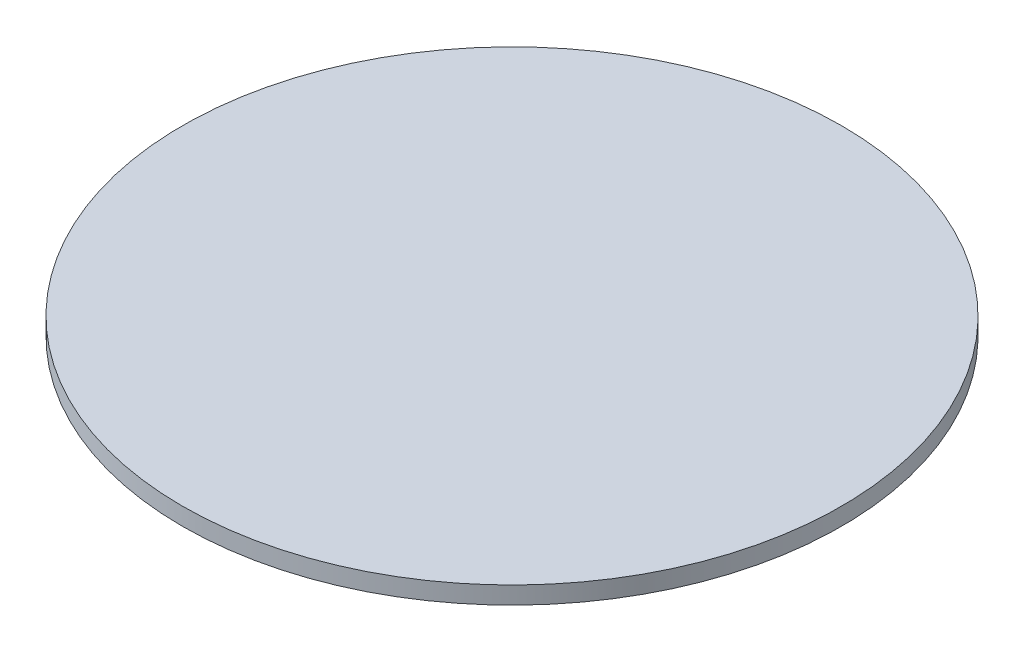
ISO-10303-21;
HEADER;
FILE_DESCRIPTION(('STEP AP214'),'2;1');
FILE_NAME('part.step','',(''),(''),'','','');
FILE_SCHEMA(('AUTOMOTIVE_DESIGN { 1 0 10303 214 1 1 1 1 }'));
ENDSEC;
DATA;
#1=APPLICATION_CONTEXT('core data for automotive mechanical design processes');
#2=APPLICATION_PROTOCOL_DEFINITION('international standard','automotive_design',2000,#1);
#3=PRODUCT_CONTEXT('',#1,'mechanical');
#4=PRODUCT('Part','Part','',(#3));
#5=PRODUCT_RELATED_PRODUCT_CATEGORY('part','',(#4));
#6=PRODUCT_DEFINITION_FORMATION('','',#4);
#7=PRODUCT_DEFINITION_CONTEXT('part definition',#1,'design');
#8=PRODUCT_DEFINITION('design','',#6,#7);
#9=PRODUCT_DEFINITION_SHAPE('','',#8);
#10=(LENGTH_UNIT() NAMED_UNIT(*) SI_UNIT(.MILLI.,.METRE.));
#11=(NAMED_UNIT(*) PLANE_ANGLE_UNIT() SI_UNIT($,.RADIAN.));
#12=(NAMED_UNIT(*) SI_UNIT($,.STERADIAN.) SOLID_ANGLE_UNIT());
#13=UNCERTAINTY_MEASURE_WITH_UNIT(LENGTH_MEASURE(1.E-05),#10,'distance_accuracy_value','');
#14=(GEOMETRIC_REPRESENTATION_CONTEXT(3) GLOBAL_UNCERTAINTY_ASSIGNED_CONTEXT((#13)) GLOBAL_UNIT_ASSIGNED_CONTEXT((#10,
#11,#12)) REPRESENTATION_CONTEXT('',''));
#15=CARTESIAN_POINT('',(0.,0.,0.));
#16=DIRECTION('',(0.,0.,1.));
#17=DIRECTION('',(1.,0.,0.));
#18=AXIS2_PLACEMENT_3D('',#15,#16,#17);
#19=CARTESIAN_POINT('',(0.,4.,0.));
#20=DIRECTION('',(0.,-1.,0.));
#21=DIRECTION('',(0.,0.,-1.));
#22=AXIS2_PLACEMENT_3D('',#19,#20,#21);
#23=CYLINDRICAL_SURFACE('',#22,75.5);
#24=CARTESIAN_POINT('',(0.,4.,0.));
#25=DIRECTION('',(0.,1.,0.));
#26=DIRECTION('',(0.,0.,1.));
#27=AXIS2_PLACEMENT_3D('',#24,#25,#26);
#28=CIRCLE('',#27,75.5);
#29=CARTESIAN_POINT('',(0.,4.,75.5));
#30=VERTEX_POINT('',#29);
#31=EDGE_CURVE('E10',#30,#30,#28,.T.);
#32=ORIENTED_EDGE('',*,*,#31,.F.);
#33=EDGE_LOOP('',(#32));
#34=FACE_BOUND('',#33,.T.);
#35=CARTESIAN_POINT('',(0.,0.,0.));
#36=DIRECTION('',(0.,1.,0.));
#37=DIRECTION('',(0.,0.,1.));
#38=AXIS2_PLACEMENT_3D('',#35,#36,#37);
#39=CIRCLE('',#38,75.5);
#40=CARTESIAN_POINT('',(0.,0.,75.5));
#41=VERTEX_POINT('',#40);
#42=EDGE_CURVE('E40',#41,#41,#39,.T.);
#43=ORIENTED_EDGE('',*,*,#42,.T.);
#44=EDGE_LOOP('',(#43));
#45=FACE_BOUND('',#44,.T.);
#46=ADVANCED_FACE('F37',(#34,#45),#23,.T.);
#47=CARTESIAN_POINT('',(0.,4.,0.));
#48=DIRECTION('',(0.,1.,0.));
#49=DIRECTION('',(0.,0.,1.));
#50=AXIS2_PLACEMENT_3D('',#47,#48,#49);
#51=PLANE('',#50);
#52=ORIENTED_EDGE('',*,*,#31,.T.);
#53=EDGE_LOOP('',(#52));
#54=FACE_BOUND('',#53,.T.);
#55=ADVANCED_FACE('F54',(#54),#51,.T.);
#56=CARTESIAN_POINT('',(0.,0.,0.));
#57=DIRECTION('',(0.,1.,0.));
#58=DIRECTION('',(0.,0.,1.));
#59=AXIS2_PLACEMENT_3D('',#56,#57,#58);
#60=PLANE('',#59);
#61=ORIENTED_EDGE('',*,*,#42,.F.);
#62=EDGE_LOOP('',(#61));
#63=FACE_BOUND('',#62,.T.);
#64=ADVANCED_FACE('F52',(#63),#60,.F.);
#65=CLOSED_SHELL('',(#46,#55,#64));
#66=MANIFOLD_SOLID_BREP('B2',#65);
#67=ADVANCED_BREP_SHAPE_REPRESENTATION('',(#18,#66),#14);
#68=SHAPE_DEFINITION_REPRESENTATION(#9,#67);
ENDSEC;
END-ISO-10303-21;
